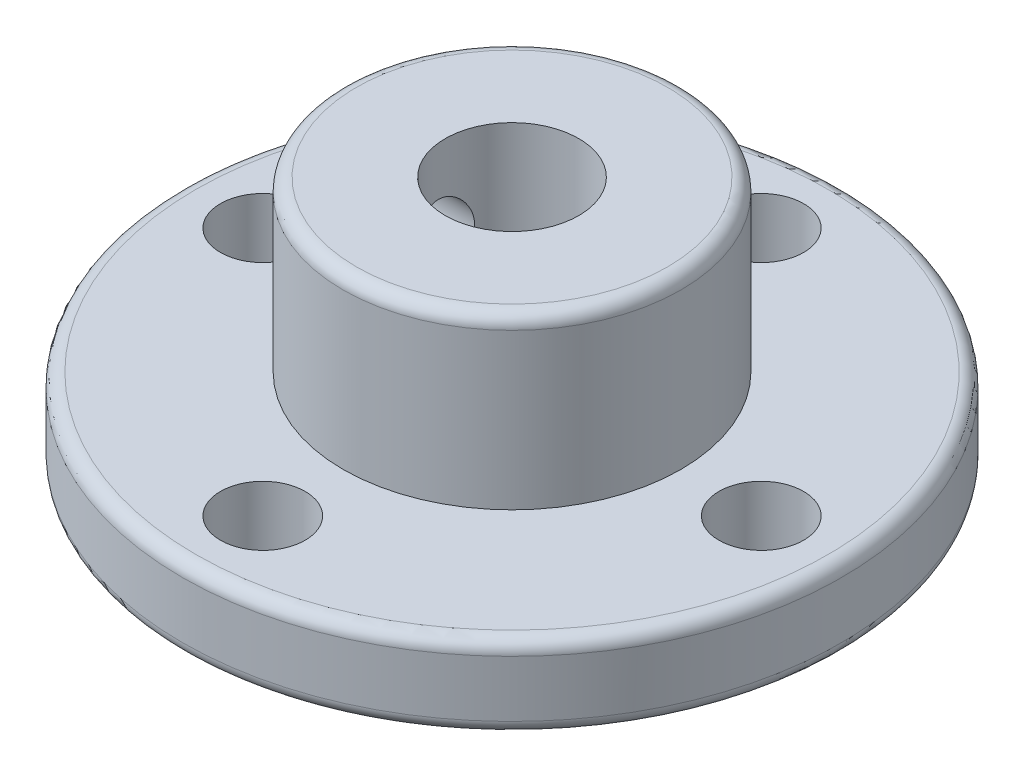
ISO-10303-21;
HEADER;
FILE_DESCRIPTION(('STEP AP214'),'2;1');
FILE_NAME('part.step','',(''),(''),'','','');
FILE_SCHEMA(('AUTOMOTIVE_DESIGN { 1 0 10303 214 1 1 1 1 }'));
ENDSEC;
DATA;
#1=APPLICATION_CONTEXT('core data for automotive mechanical design processes');
#2=APPLICATION_PROTOCOL_DEFINITION('international standard','automotive_design',2000,#1);
#3=PRODUCT_CONTEXT('',#1,'mechanical');
#4=PRODUCT('Part','Part','',(#3));
#5=PRODUCT_RELATED_PRODUCT_CATEGORY('part','',(#4));
#6=PRODUCT_DEFINITION_FORMATION('','',#4);
#7=PRODUCT_DEFINITION_CONTEXT('part definition',#1,'design');
#8=PRODUCT_DEFINITION('design','',#6,#7);
#9=PRODUCT_DEFINITION_SHAPE('','',#8);
#10=(LENGTH_UNIT() NAMED_UNIT(*) SI_UNIT(.MILLI.,.METRE.));
#11=(NAMED_UNIT(*) PLANE_ANGLE_UNIT() SI_UNIT($,.RADIAN.));
#12=(NAMED_UNIT(*) SI_UNIT($,.STERADIAN.) SOLID_ANGLE_UNIT());
#13=UNCERTAINTY_MEASURE_WITH_UNIT(LENGTH_MEASURE(1.E-05),#10,'distance_accuracy_value','');
#14=(GEOMETRIC_REPRESENTATION_CONTEXT(3) GLOBAL_UNCERTAINTY_ASSIGNED_CONTEXT((#13)) GLOBAL_UNIT_ASSIGNED_CONTEXT((#10,
#11,#12)) REPRESENTATION_CONTEXT('',''));
#15=CARTESIAN_POINT('',(0.,0.,0.));
#16=DIRECTION('',(0.,0.,1.));
#17=DIRECTION('',(1.,0.,0.));
#18=AXIS2_PLACEMENT_3D('',#15,#16,#17);
#19=CARTESIAN_POINT('',(0.,8.9361,0.));
#20=DIRECTION('',(0.,1.,0.));
#21=DIRECTION('',(0.,0.,1.));
#22=AXIS2_PLACEMENT_3D('',#19,#20,#21);
#23=TOROIDAL_SURFACE('',#22,5.83095,0.5);
#24=CARTESIAN_POINT('',(0.,9.4361,0.));
#25=DIRECTION('',(0.,-1.,0.));
#26=DIRECTION('',(1.,0.,0.));
#27=AXIS2_PLACEMENT_3D('',#24,#25,#26);
#28=CIRCLE('',#27,5.83095);
#29=CARTESIAN_POINT('',(5.83095,9.4361,0.));
#30=VERTEX_POINT('',#29);
#31=EDGE_CURVE('E131',#30,#30,#28,.F.);
#32=ORIENTED_EDGE('',*,*,#31,.F.);
#33=EDGE_LOOP('',(#32));
#34=FACE_BOUND('',#33,.T.);
#35=CARTESIAN_POINT('',(0.,8.9361,0.));
#36=DIRECTION('',(0.,1.,0.));
#37=DIRECTION('',(0.,0.,1.));
#38=AXIS2_PLACEMENT_3D('',#35,#36,#37);
#39=CIRCLE('',#38,6.33095);
#40=CARTESIAN_POINT('',(0.,8.9361,6.33095));
#41=VERTEX_POINT('',#40);
#42=EDGE_CURVE('E153',#41,#41,#39,.F.);
#43=ORIENTED_EDGE('',*,*,#42,.F.);
#44=EDGE_LOOP('',(#43));
#45=FACE_BOUND('',#44,.T.);
#46=ADVANCED_FACE('F33',(#34,#45),#23,.T.);
#47=CARTESIAN_POINT('',(0.,3.1115,0.));
#48=DIRECTION('',(0.,1.,0.));
#49=DIRECTION('',(0.,0.,1.));
#50=AXIS2_PLACEMENT_3D('',#47,#48,#49);
#51=CYLINDRICAL_SURFACE('',#50,6.33095);
#52=ORIENTED_EDGE('',*,*,#42,.T.);
#53=EDGE_LOOP('',(#52));
#54=FACE_BOUND('',#53,.T.);
#55=CARTESIAN_POINT('',(-6.26356410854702,6.274,-0.9212451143));
#56=CARTESIAN_POINT('',(-6.26356540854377,6.34877461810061,-0.921242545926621));
#57=CARTESIAN_POINT('',(-6.26449924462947,6.42358162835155,-0.91495458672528));
#58=CARTESIAN_POINT('',(-6.2680952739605,6.57109055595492,-0.889979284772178));
#59=CARTESIAN_POINT('',(-6.27075875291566,6.6437908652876,-0.871282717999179));
#60=CARTESIAN_POINT('',(-6.27740077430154,6.78494880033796,-0.822058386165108));
#61=CARTESIAN_POINT('',(-6.2813784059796,6.85340932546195,-0.791538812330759));
#62=CARTESIAN_POINT('',(-6.29003135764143,6.98424318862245,-0.719542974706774));
#63=CARTESIAN_POINT('',(-6.29470662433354,7.04661699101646,-0.67806754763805));
#64=CARTESIAN_POINT('',(-6.3040406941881,7.1639965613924,-0.584975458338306));
#65=CARTESIAN_POINT('',(-6.30869915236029,7.21894763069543,-0.533289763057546));
#66=CARTESIAN_POINT('',(-6.31715940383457,7.3194267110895,-0.421386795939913));
#67=CARTESIAN_POINT('',(-6.32096118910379,7.36495463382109,-0.361169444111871));
#68=CARTESIAN_POINT('',(-6.32694761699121,7.44526247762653,-0.233905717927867));
#69=CARTESIAN_POINT('',(-6.32913292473,7.48004681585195,-0.166862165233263));
#70=CARTESIAN_POINT('',(-6.33126981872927,7.53785884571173,-0.0278529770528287));
#71=CARTESIAN_POINT('',(-6.33122166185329,7.56088788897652,0.0441120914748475));
#72=CARTESIAN_POINT('',(-6.3285182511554,7.59426846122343,0.18976426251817));
#73=CARTESIAN_POINT('',(-6.32590122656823,7.60480088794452,0.263410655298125));
#74=CARTESIAN_POINT('',(-6.31801022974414,7.61353987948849,0.411285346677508));
#75=CARTESIAN_POINT('',(-6.31273637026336,7.61174696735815,0.485513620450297));
#76=CARTESIAN_POINT('',(-6.29974802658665,7.59602168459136,0.632050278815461));
#77=CARTESIAN_POINT('',(-6.2920464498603,7.58215284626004,0.704366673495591));
#78=CARTESIAN_POINT('',(-6.27463672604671,7.54285672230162,0.845531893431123));
#79=CARTESIAN_POINT('',(-6.26492836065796,7.5174281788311,0.914380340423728));
#80=CARTESIAN_POINT('',(-6.24396616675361,7.45520103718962,1.04808520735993));
#81=CARTESIAN_POINT('',(-6.23268672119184,7.41819772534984,1.11284227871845));
#82=CARTESIAN_POINT('',(-6.20958356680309,7.33402100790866,1.23526796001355));
#83=CARTESIAN_POINT('',(-6.19775976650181,7.2868458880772,1.29293537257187));
#84=CARTESIAN_POINT('',(-6.17426440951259,7.18237952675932,1.40089667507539));
#85=CARTESIAN_POINT('',(-6.16260216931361,7.12488566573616,1.45099684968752));
#86=CARTESIAN_POINT('',(-6.14076012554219,7.00203917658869,1.54082330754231));
#87=CARTESIAN_POINT('',(-6.13058027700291,6.93668678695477,1.58054990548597));
#88=CARTESIAN_POINT('',(-6.11275587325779,6.80041006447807,1.64813891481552));
#89=CARTESIAN_POINT('',(-6.10509258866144,6.72953198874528,1.67608943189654));
#90=CARTESIAN_POINT('',(-6.09298203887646,6.58381101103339,1.71959709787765));
#91=CARTESIAN_POINT('',(-6.0885339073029,6.50896918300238,1.73515758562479));
#92=CARTESIAN_POINT('',(-6.08342048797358,6.36023280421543,1.75299922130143));
#93=CARTESIAN_POINT('',(-6.08262938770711,6.2863953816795,1.7557220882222));
#94=CARTESIAN_POINT('',(-6.08456804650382,6.13933001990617,1.74899162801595));
#95=CARTESIAN_POINT('',(-6.08729745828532,6.06610202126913,1.73953950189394));
#96=CARTESIAN_POINT('',(-6.09592372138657,5.92359272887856,1.70905927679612));
#97=CARTESIAN_POINT('',(-6.10176674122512,5.854265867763,1.68822776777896));
#98=CARTESIAN_POINT('',(-6.11603004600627,5.72009736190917,1.63579889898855));
#99=CARTESIAN_POINT('',(-6.12445064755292,5.65525626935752,1.60420021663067));
#100=CARTESIAN_POINT('',(-6.1433368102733,5.53022420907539,1.53030182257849));
#101=CARTESIAN_POINT('',(-6.15384571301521,5.47017802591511,1.48776844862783));
#102=CARTESIAN_POINT('',(-6.17586028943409,5.35794947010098,1.39356136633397));
#103=CARTESIAN_POINT('',(-6.18736615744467,5.3057686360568,1.34188587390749));
#104=CARTESIAN_POINT('',(-6.21081306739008,5.2089885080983,1.2288857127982));
#105=CARTESIAN_POINT('',(-6.22275602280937,5.16469339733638,1.1673005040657));
#106=CARTESIAN_POINT('',(-6.24572334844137,5.08707071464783,1.03740668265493));
#107=CARTESIAN_POINT('',(-6.25674769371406,5.05374344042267,0.969097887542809));
#108=CARTESIAN_POINT('',(-6.27705968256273,4.99898846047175,0.827394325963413));
#109=CARTESIAN_POINT('',(-6.28634249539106,4.97759353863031,0.753986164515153));
#110=CARTESIAN_POINT('',(-6.30248783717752,4.94759551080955,0.604344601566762));
#111=CARTESIAN_POINT('',(-6.30935076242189,4.93899030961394,0.528111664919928));
#112=CARTESIAN_POINT('',(-6.32016223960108,4.93499282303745,0.376938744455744));
#113=CARTESIAN_POINT('',(-6.3241768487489,4.93928806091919,0.302011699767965));
#114=CARTESIAN_POINT('',(-6.32951476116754,4.96036278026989,0.153839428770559));
#115=CARTESIAN_POINT('',(-6.33083830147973,4.97714116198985,0.0805940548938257));
#116=CARTESIAN_POINT('',(-6.33104651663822,5.02235763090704,-0.060960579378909));
#117=CARTESIAN_POINT('',(-6.32996828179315,5.05061296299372,-0.129328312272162));
#118=CARTESIAN_POINT('',(-6.32593134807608,5.11796038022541,-0.260435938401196));
#119=CARTESIAN_POINT('',(-6.32297258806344,5.15705281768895,-0.323175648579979));
#120=CARTESIAN_POINT('',(-6.31579558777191,5.2453624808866,-0.441841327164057));
#121=CARTESIAN_POINT('',(-6.31156660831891,5.29466487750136,-0.497703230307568));
#122=CARTESIAN_POINT('',(-6.30262036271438,5.40183218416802,-0.600476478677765));
#123=CARTESIAN_POINT('',(-6.29790298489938,5.45969905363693,-0.647385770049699));
#124=CARTESIAN_POINT('',(-6.28868685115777,5.58326692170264,-0.731551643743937));
#125=CARTESIAN_POINT('',(-6.2841919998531,5.64906481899,-0.768666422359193));
#126=CARTESIAN_POINT('',(-6.27621432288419,5.78598136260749,-0.831303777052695));
#127=CARTESIAN_POINT('',(-6.27273071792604,5.85709585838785,-0.856835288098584));
#128=CARTESIAN_POINT('',(-6.26793645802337,5.98589267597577,-0.891135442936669));
#129=CARTESIAN_POINT('',(-6.26631054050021,6.04291029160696,-0.902406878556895));
#130=CARTESIAN_POINT('',(-6.26412387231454,6.15794544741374,-0.917462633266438));
#131=CARTESIAN_POINT('',(-6.26356309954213,6.21596296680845,-0.9212471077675));
#132=CARTESIAN_POINT('',(-6.26356410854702,6.274,-0.9212451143));
#133=B_SPLINE_CURVE_WITH_KNOTS('',3,(#55,#56,#57,#58,#59,#60,#61,#62,#63,#64,#65,#66,#67,#68,
#69,#70,#71,#72,#73,#74,#75,#76,#77,#78,#79,#80,#81,#82,#83,#84,#85,#86,#87,#88,#89,#90,#91,#92,
#93,#94,#95,#96,#97,#98,#99,#100,#101,#102,#103,#104,#105,#106,#107,#108,#109,#110,#111,#112,
#113,#114,#115,#116,#117,#118,#119,#120,#121,#122,#123,#124,#125,#126,#127,#128,#129,#130,#131,
#132),.UNSPECIFIED.,.T.,.F.,(4,2,2,2,2,2,2,2,2,2,2,2,2,2,2,2,2,2,2,2,2,2,2,2,2,2,2,2,2,2,2,2,2,
2,2,2,2,2,4),(0.,0.224113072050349,0.448392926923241,0.672517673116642,0.896625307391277,
1.12230349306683,1.34798379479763,1.57357118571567,1.79913263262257,2.02138744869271,
2.2436328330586,2.46471598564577,2.68582320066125,2.91108604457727,3.13638688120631,
3.36672570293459,3.59705753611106,3.82563409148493,4.05414902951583,4.27474082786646,
4.49531086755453,4.71218560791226,4.9290869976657,5.15107706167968,5.37311049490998,
5.60241391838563,5.83172356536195,6.06166017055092,6.29155910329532,6.51593465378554,
6.74029043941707,6.96120558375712,7.18212791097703,7.40497329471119,7.62786974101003,
7.85383529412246,8.0796262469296,8.25357735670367,8.42752485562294),.UNSPECIFIED.);
#134=CARTESIAN_POINT('',(-6.26356410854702,6.274,-0.9212451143));
#135=VERTEX_POINT('',#134);
#136=EDGE_CURVE('E38',#135,#135,#133,.T.);
#137=ORIENTED_EDGE('',*,*,#136,.T.);
#138=EDGE_LOOP('',(#137));
#139=FACE_BOUND('',#138,.T.);
#140=CARTESIAN_POINT('',(0.,3.1115,0.));
#141=DIRECTION('',(0.,1.,0.));
#142=DIRECTION('',(0.,0.,1.));
#143=AXIS2_PLACEMENT_3D('',#140,#141,#142);
#144=CIRCLE('',#143,6.33095);
#145=CARTESIAN_POINT('',(0.,3.1115,6.33095));
#146=VERTEX_POINT('',#145);
#147=EDGE_CURVE('E92',#146,#146,#144,.F.);
#148=ORIENTED_EDGE('',*,*,#147,.F.);
#149=EDGE_LOOP('',(#148));
#150=FACE_BOUND('',#149,.T.);
#151=ADVANCED_FACE('F147',(#54,#139,#150),#51,.T.);
#152=CARTESIAN_POINT('',(0.,2.6115,0.));
#153=DIRECTION('',(0.,1.,0.));
#154=DIRECTION('',(0.,0.,1.));
#155=AXIS2_PLACEMENT_3D('',#152,#153,#154);
#156=TOROIDAL_SURFACE('',#155,11.85075,0.5);
#157=CARTESIAN_POINT('',(0.,3.1115,0.));
#158=DIRECTION('',(0.,-1.,0.));
#159=DIRECTION('',(-1.,0.,0.));
#160=AXIS2_PLACEMENT_3D('',#157,#158,#159);
#161=CIRCLE('',#160,11.85075);
#162=CARTESIAN_POINT('',(-11.85075,3.1115,0.));
#163=VERTEX_POINT('',#162);
#164=EDGE_CURVE('E166',#163,#163,#161,.F.);
#165=ORIENTED_EDGE('',*,*,#164,.F.);
#166=EDGE_LOOP('',(#165));
#167=FACE_BOUND('',#166,.T.);
#168=CARTESIAN_POINT('',(0.,2.6115,0.));
#169=DIRECTION('',(0.,1.,0.));
#170=DIRECTION('',(0.,0.,1.));
#171=AXIS2_PLACEMENT_3D('',#168,#169,#170);
#172=CIRCLE('',#171,12.35075);
#173=CARTESIAN_POINT('',(0.,2.6115,12.35075));
#174=VERTEX_POINT('',#173);
#175=EDGE_CURVE('E91',#174,#174,#172,.F.);
#176=ORIENTED_EDGE('',*,*,#175,.F.);
#177=EDGE_LOOP('',(#176));
#178=FACE_BOUND('',#177,.T.);
#179=ADVANCED_FACE('F144',(#167,#178),#156,.T.);
#180=CARTESIAN_POINT('',(-36.1851929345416,6.274,0.4162548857));
#181=DIRECTION('',(1.,0.,0.));
#182=DIRECTION('',(0.,0.,-1.));
#183=AXIS2_PLACEMENT_3D('',#180,#181,#182);
#184=CYLINDRICAL_SURFACE('',#183,1.3375);
#185=ORIENTED_EDGE('',*,*,#136,.F.);
#186=EDGE_LOOP('',(#185));
#187=FACE_BOUND('',#186,.T.);
#188=CARTESIAN_POINT('',(-2.32611501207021,6.274,-0.9212451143));
#189=CARTESIAN_POINT('',(-2.32611521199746,6.3467020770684,-0.921244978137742));
#190=CARTESIAN_POINT('',(-2.32849799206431,6.41940549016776,-0.915295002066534));
#191=CARTESIAN_POINT('',(-2.33761473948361,6.56262588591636,-0.891748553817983));
#192=CARTESIAN_POINT('',(-2.34435032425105,6.63314204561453,-0.874147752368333));
#193=CARTESIAN_POINT('',(-2.3610328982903,6.76985663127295,-0.828022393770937));
#194=CARTESIAN_POINT('',(-2.37097105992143,6.83606633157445,-0.799527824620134));
#195=CARTESIAN_POINT('',(-2.39254224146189,6.96286305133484,-0.732449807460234));
#196=CARTESIAN_POINT('',(-2.40417580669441,7.02344825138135,-0.693863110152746));
#197=CARTESIAN_POINT('',(-2.42797074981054,7.14031746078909,-0.60551288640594));
#198=CARTESIAN_POINT('',(-2.44013177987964,7.1962752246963,-0.555316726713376));
#199=CARTESIAN_POINT('',(-2.46245375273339,7.29919556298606,-0.446017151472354));
#200=CARTESIAN_POINT('',(-2.47261469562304,7.3461581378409,-0.386913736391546));
#201=CARTESIAN_POINT('',(-2.48903984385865,7.4297331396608,-0.261159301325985));
#202=CARTESIAN_POINT('',(-2.49529927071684,7.46633284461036,-0.194499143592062));
#203=CARTESIAN_POINT('',(-2.50224160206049,7.52775915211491,-0.0557001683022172));
#204=CARTESIAN_POINT('',(-2.5029287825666,7.55259476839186,0.0164344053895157));
#205=CARTESIAN_POINT('',(-2.4978496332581,7.58808550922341,0.157537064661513));
#206=CARTESIAN_POINT('',(-2.49261276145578,7.5997442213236,0.226273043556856));
#207=CARTESIAN_POINT('',(-2.47624782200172,7.61226651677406,0.364014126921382));
#208=CARTESIAN_POINT('',(-2.4651206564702,7.61313175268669,0.433019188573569));
#209=CARTESIAN_POINT('',(-2.43779999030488,7.60463979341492,0.566675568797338));
#210=CARTESIAN_POINT('',(-2.42180851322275,7.59565849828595,0.631393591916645));
#211=CARTESIAN_POINT('',(-2.38533756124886,7.56881385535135,0.757620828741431));
#212=CARTESIAN_POINT('',(-2.36485710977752,7.55094857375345,0.819129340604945));
#213=CARTESIAN_POINT('',(-2.31853750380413,7.50546033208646,0.942646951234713));
#214=CARTESIAN_POINT('',(-2.29239891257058,7.47716504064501,1.00429417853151));
#215=CARTESIAN_POINT('',(-2.2372965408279,7.41231088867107,1.12170524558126));
#216=CARTESIAN_POINT('',(-2.20833064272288,7.37574580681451,1.17746460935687));
#217=CARTESIAN_POINT('',(-2.1444880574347,7.28906101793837,1.29054414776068));
#218=CARTESIAN_POINT('',(-2.10938389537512,7.23772436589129,1.34680410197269));
#219=CARTESIAN_POINT('',(-2.03978343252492,7.12602722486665,1.45005573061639));
#220=CARTESIAN_POINT('',(-2.00528736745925,7.06566331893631,1.49704387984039));
#221=CARTESIAN_POINT('',(-1.94499738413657,6.94632362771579,1.57432878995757));
#222=CARTESIAN_POINT('',(-1.91868051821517,6.88855732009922,1.60608056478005));
#223=CARTESIAN_POINT('',(-1.87111358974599,6.76725735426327,1.66125398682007));
#224=CARTESIAN_POINT('',(-1.84985401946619,6.70373483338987,1.68469130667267));
#225=CARTESIAN_POINT('',(-1.81869708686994,6.58512800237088,1.71821493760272));
#226=CARTESIAN_POINT('',(-1.80737433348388,6.53091699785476,1.73003860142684));
#227=CARTESIAN_POINT('',(-1.79111191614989,6.42052615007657,1.74687254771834));
#228=CARTESIAN_POINT('',(-1.78616468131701,6.36434872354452,1.75189091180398));
#229=CARTESIAN_POINT('',(-1.78334816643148,6.25147739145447,1.75475883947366));
#230=CARTESIAN_POINT('',(-1.78549735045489,6.19478252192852,1.75258970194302));
#231=CARTESIAN_POINT('',(-1.79659030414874,6.08277148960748,1.74121373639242));
#232=CARTESIAN_POINT('',(-1.80554051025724,6.02745668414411,1.73200024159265));
#233=CARTESIAN_POINT('',(-1.83148529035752,5.90851133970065,1.70457773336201));
#234=CARTESIAN_POINT('',(-1.84975299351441,5.84550122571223,1.68491163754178));
#235=CARTESIAN_POINT('',(-1.89189373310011,5.72461470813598,1.63745110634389));
#236=CARTESIAN_POINT('',(-1.91577815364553,5.66674906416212,1.60964013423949));
#237=CARTESIAN_POINT('',(-1.97414401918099,5.54078241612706,1.53784311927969));
#238=CARTESIAN_POINT('',(-2.00969790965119,5.47452172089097,1.49150549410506));
#239=CARTESIAN_POINT('',(-2.08234483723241,5.35177521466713,1.38828627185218));
#240=CARTESIAN_POINT('',(-2.11943913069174,5.29529758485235,1.33139593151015));
#241=CARTESIAN_POINT('',(-2.19250216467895,5.19250346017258,1.20733941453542));
#242=CARTESIAN_POINT('',(-2.22845764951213,5.14628374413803,1.14008473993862));
#243=CARTESIAN_POINT('',(-2.29615483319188,5.06623708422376,0.996711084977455));
#244=CARTESIAN_POINT('',(-2.32790332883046,5.03238999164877,0.920606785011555));
#245=CARTESIAN_POINT('',(-2.37911873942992,4.98434077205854,0.777108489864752));
#246=CARTESIAN_POINT('',(-2.3997723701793,4.96756887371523,0.710997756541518));
#247=CARTESIAN_POINT('',(-2.43579251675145,4.94425366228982,0.575597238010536));
#248=CARTESIAN_POINT('',(-2.45116234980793,4.93770392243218,0.506309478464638));
#249=CARTESIAN_POINT('',(-2.47597449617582,4.93559569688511,0.366236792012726));
#250=CARTESIAN_POINT('',(-2.4853955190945,4.94007641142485,0.295447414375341));
#251=CARTESIAN_POINT('',(-2.49809355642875,4.96035689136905,0.154942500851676));
#252=CARTESIAN_POINT('',(-2.50137076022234,4.97615630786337,0.0852269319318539));
#253=CARTESIAN_POINT('',(-2.50228252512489,5.01739228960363,-0.0467075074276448));
#254=CARTESIAN_POINT('',(-2.50024407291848,5.04219325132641,-0.109125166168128));
#255=CARTESIAN_POINT('',(-2.49209654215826,5.10071340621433,-0.22932663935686));
#256=CARTESIAN_POINT('',(-2.48598692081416,5.13443378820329,-0.287109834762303));
#257=CARTESIAN_POINT('',(-2.47053411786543,5.21151145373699,-0.399126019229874));
#258=CARTESIAN_POINT('',(-2.46106231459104,5.2552229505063,-0.453096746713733));
#259=CARTESIAN_POINT('',(-2.44044645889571,5.35027042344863,-0.553494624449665));
#260=CARTESIAN_POINT('',(-2.42930151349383,5.40161047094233,-0.599917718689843));
#261=CARTESIAN_POINT('',(-2.40596320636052,5.51536226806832,-0.687810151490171));
#262=CARTESIAN_POINT('',(-2.39375965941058,5.5783394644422,-0.728547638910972));
#263=CARTESIAN_POINT('',(-2.37116348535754,5.71046694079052,-0.79903930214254));
#264=CARTESIAN_POINT('',(-2.36077047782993,5.77961591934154,-0.82879578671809));
#265=CARTESIAN_POINT('',(-2.34395762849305,5.91876226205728,-0.87518457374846));
#266=CARTESIAN_POINT('',(-2.33736482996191,5.98854359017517,-0.892399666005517));
#267=CARTESIAN_POINT('',(-2.32844441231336,6.13021684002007,-0.915427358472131));
#268=CARTESIAN_POINT('',(-2.32611481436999,6.202107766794,-0.921245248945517));
#269=CARTESIAN_POINT('',(-2.32611501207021,6.274,-0.9212451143));
#270=B_SPLINE_CURVE_WITH_KNOTS('',3,(#188,#189,#190,#191,#192,#193,#194,#195,#196,#197,#198,
#199,#200,#201,#202,#203,#204,#205,#206,#207,#208,#209,#210,#211,#212,#213,#214,#215,#216,#217,
#218,#219,#220,#221,#222,#223,#224,#225,#226,#227,#228,#229,#230,#231,#232,#233,#234,#235,#236,
#237,#238,#239,#240,#241,#242,#243,#244,#245,#246,#247,#248,#249,#250,#251,#252,#253,#254,#255,
#256,#257,#258,#259,#260,#261,#262,#263,#264,#265,#266,#267,#268,#269),.UNSPECIFIED.,.T.,.F.,(4,
2,2,2,2,2,2,2,2,2,2,2,2,2,2,2,2,2,2,2,2,2,2,2,2,2,2,2,2,2,2,2,2,2,2,2,2,2,2,2,4),(0.,
0.217835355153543,0.435751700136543,0.653072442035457,0.870463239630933,1.09785824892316,
1.32525324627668,1.55292620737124,1.780424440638,1.98909233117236,2.19772827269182,
2.39866820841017,2.59965190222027,2.81689108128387,3.03429423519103,3.28487234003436,
3.5355455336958,3.74773681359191,3.95952596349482,4.12870820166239,4.29768935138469,
4.46711051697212,4.63669222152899,4.84104461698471,5.04581482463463,5.30945662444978,
5.57331784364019,5.83957160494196,6.10538982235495,6.31827566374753,6.53102760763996,
6.74453672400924,6.95803925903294,7.15872244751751,7.35943239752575,7.56883779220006,
7.77835534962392,8.00527743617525,8.23215178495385,8.4476606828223,8.66306952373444),.UNSPECIFIED.);
#271=CARTESIAN_POINT('',(-2.32611501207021,6.274,-0.9212451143));
#272=VERTEX_POINT('',#271);
#273=EDGE_CURVE('E86',#272,#272,#270,.T.);
#274=ORIENTED_EDGE('',*,*,#273,.T.);
#275=EDGE_LOOP('',(#274));
#276=FACE_BOUND('',#275,.T.);
#277=ADVANCED_FACE('F93',(#187,#276),#184,.F.);
#278=CARTESIAN_POINT('',(0.,9.4361,0.));
#279=DIRECTION('',(0.,1.,0.));
#280=DIRECTION('',(0.,0.,1.));
#281=AXIS2_PLACEMENT_3D('',#278,#279,#280);
#282=PLANE('',#281);
#283=ORIENTED_EDGE('',*,*,#31,.T.);
#284=EDGE_LOOP('',(#283));
#285=FACE_BOUND('',#284,.T.);
#286=CARTESIAN_POINT('',(0.,9.4361,0.));
#287=DIRECTION('',(0.,1.,0.));
#288=DIRECTION('',(0.,0.,1.));
#289=AXIS2_PLACEMENT_3D('',#286,#287,#288);
#290=CIRCLE('',#289,2.5019);
#291=CARTESIAN_POINT('',(0.,9.4361,2.5019));
#292=VERTEX_POINT('',#291);
#293=EDGE_CURVE('E83',#292,#292,#290,.F.);
#294=ORIENTED_EDGE('',*,*,#293,.T.);
#295=EDGE_LOOP('',(#294));
#296=FACE_BOUND('',#295,.T.);
#297=ADVANCED_FACE('F112',(#285,#296),#282,.T.);
#298=CARTESIAN_POINT('',(0.,3.1115,0.));
#299=DIRECTION('',(0.,1.,0.));
#300=DIRECTION('',(0.,0.,1.));
#301=AXIS2_PLACEMENT_3D('',#298,#299,#300);
#302=PLANE('',#301);
#303=ORIENTED_EDGE('',*,*,#164,.T.);
#304=EDGE_LOOP('',(#303));
#305=FACE_BOUND('',#304,.T.);
#306=CARTESIAN_POINT('',(0.,3.1115,9.341));
#307=DIRECTION('',(0.,1.,0.));
#308=DIRECTION('',(0.,0.,1.));
#309=AXIS2_PLACEMENT_3D('',#306,#307,#308);
#310=CIRCLE('',#309,1.5875);
#311=CARTESIAN_POINT('',(0.,3.1115,10.9285));
#312=VERTEX_POINT('',#311);
#313=EDGE_CURVE('E71',#312,#312,#310,.F.);
#314=ORIENTED_EDGE('',*,*,#313,.T.);
#315=EDGE_LOOP('',(#314));
#316=FACE_BOUND('',#315,.T.);
#317=CARTESIAN_POINT('',(-9.341,3.1115,0.));
#318=DIRECTION('',(0.,1.,0.));
#319=DIRECTION('',(0.,0.,1.));
#320=AXIS2_PLACEMENT_3D('',#317,#318,#319);
#321=CIRCLE('',#320,1.5875);
#322=CARTESIAN_POINT('',(-9.341,3.1115,1.5875));
#323=VERTEX_POINT('',#322);
#324=EDGE_CURVE('E74',#323,#323,#321,.F.);
#325=ORIENTED_EDGE('',*,*,#324,.T.);
#326=EDGE_LOOP('',(#325));
#327=FACE_BOUND('',#326,.T.);
#328=CARTESIAN_POINT('',(0.,3.1115,-9.341));
#329=DIRECTION('',(0.,1.,0.));
#330=DIRECTION('',(0.,0.,1.));
#331=AXIS2_PLACEMENT_3D('',#328,#329,#330);
#332=CIRCLE('',#331,1.5875);
#333=CARTESIAN_POINT('',(0.,3.1115,-7.7535));
#334=VERTEX_POINT('',#333);
#335=EDGE_CURVE('E77',#334,#334,#332,.F.);
#336=ORIENTED_EDGE('',*,*,#335,.T.);
#337=EDGE_LOOP('',(#336));
#338=FACE_BOUND('',#337,.T.);
#339=CARTESIAN_POINT('',(9.341,3.1115,0.));
#340=DIRECTION('',(0.,1.,0.));
#341=DIRECTION('',(0.,0.,1.));
#342=AXIS2_PLACEMENT_3D('',#339,#340,#341);
#343=CIRCLE('',#342,1.5875);
#344=CARTESIAN_POINT('',(9.341,3.1115,1.5875));
#345=VERTEX_POINT('',#344);
#346=EDGE_CURVE('E80',#345,#345,#343,.F.);
#347=ORIENTED_EDGE('',*,*,#346,.T.);
#348=EDGE_LOOP('',(#347));
#349=FACE_BOUND('',#348,.T.);
#350=ORIENTED_EDGE('',*,*,#147,.T.);
#351=EDGE_LOOP('',(#350));
#352=FACE_BOUND('',#351,.T.);
#353=ADVANCED_FACE('F108',(#305,#316,#327,#338,#349,#352),#302,.T.);
#354=CARTESIAN_POINT('',(0.,0.,0.));
#355=DIRECTION('',(0.,1.,0.));
#356=DIRECTION('',(0.,0.,1.));
#357=AXIS2_PLACEMENT_3D('',#354,#355,#356);
#358=CYLINDRICAL_SURFACE('',#357,12.35075);
#359=CARTESIAN_POINT('',(0.,0.5,0.));
#360=DIRECTION('',(0.,-1.,0.));
#361=DIRECTION('',(0.,0.,-1.));
#362=AXIS2_PLACEMENT_3D('',#359,#360,#361);
#363=CIRCLE('',#362,12.35075);
#364=CARTESIAN_POINT('',(0.,0.5,-12.35075));
#365=VERTEX_POINT('',#364);
#366=EDGE_CURVE('E70',#365,#365,#363,.T.);
#367=ORIENTED_EDGE('',*,*,#366,.F.);
#368=EDGE_LOOP('',(#367));
#369=FACE_BOUND('',#368,.T.);
#370=ORIENTED_EDGE('',*,*,#175,.T.);
#371=EDGE_LOOP('',(#370));
#372=FACE_BOUND('',#371,.T.);
#373=ADVANCED_FACE('F103',(#369,#372),#358,.T.);
#374=CARTESIAN_POINT('',(0.,-26.7490929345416,0.));
#375=DIRECTION('',(0.,1.,0.));
#376=DIRECTION('',(0.,0.,1.));
#377=AXIS2_PLACEMENT_3D('',#374,#375,#376);
#378=CYLINDRICAL_SURFACE('',#377,2.5019);
#379=ORIENTED_EDGE('',*,*,#293,.F.);
#380=EDGE_LOOP('',(#379));
#381=FACE_BOUND('',#380,.T.);
#382=CARTESIAN_POINT('',(0.,0.,0.));
#383=DIRECTION('',(0.,1.,0.));
#384=DIRECTION('',(0.,0.,1.));
#385=AXIS2_PLACEMENT_3D('',#382,#383,#384);
#386=CIRCLE('',#385,2.5019);
#387=CARTESIAN_POINT('',(0.,0.,2.5019));
#388=VERTEX_POINT('',#387);
#389=EDGE_CURVE('E67',#388,#388,#386,.F.);
#390=ORIENTED_EDGE('',*,*,#389,.T.);
#391=EDGE_LOOP('',(#390));
#392=FACE_BOUND('',#391,.T.);
#393=ORIENTED_EDGE('',*,*,#273,.F.);
#394=EDGE_LOOP('',(#393));
#395=FACE_BOUND('',#394,.T.);
#396=ADVANCED_FACE('F97',(#381,#392,#395),#378,.F.);
#397=CARTESIAN_POINT('',(9.341,-33.0736929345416,0.));
#398=DIRECTION('',(0.,1.,0.));
#399=DIRECTION('',(0.,0.,1.));
#400=AXIS2_PLACEMENT_3D('',#397,#398,#399);
#401=CYLINDRICAL_SURFACE('',#400,1.5875);
#402=ORIENTED_EDGE('',*,*,#346,.F.);
#403=EDGE_LOOP('',(#402));
#404=FACE_BOUND('',#403,.T.);
#405=CARTESIAN_POINT('',(9.341,0.,0.));
#406=DIRECTION('',(0.,1.,0.));
#407=DIRECTION('',(0.,0.,1.));
#408=AXIS2_PLACEMENT_3D('',#405,#406,#407);
#409=CIRCLE('',#408,1.5875);
#410=CARTESIAN_POINT('',(9.341,0.,1.5875));
#411=VERTEX_POINT('',#410);
#412=EDGE_CURVE('E64',#411,#411,#409,.F.);
#413=ORIENTED_EDGE('',*,*,#412,.T.);
#414=EDGE_LOOP('',(#413));
#415=FACE_BOUND('',#414,.T.);
#416=ADVANCED_FACE('F102',(#404,#415),#401,.F.);
#417=CARTESIAN_POINT('',(0.,-33.0736929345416,-9.341));
#418=DIRECTION('',(0.,1.,0.));
#419=DIRECTION('',(0.,0.,1.));
#420=AXIS2_PLACEMENT_3D('',#417,#418,#419);
#421=CYLINDRICAL_SURFACE('',#420,1.5875);
#422=ORIENTED_EDGE('',*,*,#335,.F.);
#423=EDGE_LOOP('',(#422));
#424=FACE_BOUND('',#423,.T.);
#425=CARTESIAN_POINT('',(0.,0.,-9.341));
#426=DIRECTION('',(0.,1.,0.));
#427=DIRECTION('',(0.,0.,1.));
#428=AXIS2_PLACEMENT_3D('',#425,#426,#427);
#429=CIRCLE('',#428,1.5875);
#430=CARTESIAN_POINT('',(0.,0.,-7.7535));
#431=VERTEX_POINT('',#430);
#432=EDGE_CURVE('E55',#431,#431,#429,.F.);
#433=ORIENTED_EDGE('',*,*,#432,.T.);
#434=EDGE_LOOP('',(#433));
#435=FACE_BOUND('',#434,.T.);
#436=ADVANCED_FACE('F228',(#424,#435),#421,.F.);
#437=CARTESIAN_POINT('',(-9.341,-33.0736929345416,0.));
#438=DIRECTION('',(0.,1.,0.));
#439=DIRECTION('',(0.,0.,1.));
#440=AXIS2_PLACEMENT_3D('',#437,#438,#439);
#441=CYLINDRICAL_SURFACE('',#440,1.5875);
#442=ORIENTED_EDGE('',*,*,#324,.F.);
#443=EDGE_LOOP('',(#442));
#444=FACE_BOUND('',#443,.T.);
#445=CARTESIAN_POINT('',(-9.341,0.,0.));
#446=DIRECTION('',(0.,1.,0.));
#447=DIRECTION('',(0.,0.,1.));
#448=AXIS2_PLACEMENT_3D('',#445,#446,#447);
#449=CIRCLE('',#448,1.5875);
#450=CARTESIAN_POINT('',(-9.341,0.,1.5875));
#451=VERTEX_POINT('',#450);
#452=EDGE_CURVE('E50',#451,#451,#449,.F.);
#453=ORIENTED_EDGE('',*,*,#452,.T.);
#454=EDGE_LOOP('',(#453));
#455=FACE_BOUND('',#454,.T.);
#456=ADVANCED_FACE('F237',(#444,#455),#441,.F.);
#457=CARTESIAN_POINT('',(0.,-33.0736929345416,9.341));
#458=DIRECTION('',(0.,1.,0.));
#459=DIRECTION('',(0.,0.,1.));
#460=AXIS2_PLACEMENT_3D('',#457,#458,#459);
#461=CYLINDRICAL_SURFACE('',#460,1.5875);
#462=ORIENTED_EDGE('',*,*,#313,.F.);
#463=EDGE_LOOP('',(#462));
#464=FACE_BOUND('',#463,.T.);
#465=CARTESIAN_POINT('',(0.,0.,9.341));
#466=DIRECTION('',(0.,1.,0.));
#467=DIRECTION('',(0.,0.,1.));
#468=AXIS2_PLACEMENT_3D('',#465,#466,#467);
#469=CIRCLE('',#468,1.5875);
#470=CARTESIAN_POINT('',(0.,0.,10.9285));
#471=VERTEX_POINT('',#470);
#472=EDGE_CURVE('E45',#471,#471,#469,.F.);
#473=ORIENTED_EDGE('',*,*,#472,.T.);
#474=EDGE_LOOP('',(#473));
#475=FACE_BOUND('',#474,.T.);
#476=ADVANCED_FACE('F246',(#464,#475),#461,.F.);
#477=CARTESIAN_POINT('',(0.,0.5,0.));
#478=DIRECTION('',(0.,-1.,0.));
#479=DIRECTION('',(0.,0.,-1.));
#480=AXIS2_PLACEMENT_3D('',#477,#478,#479);
#481=TOROIDAL_SURFACE('',#480,11.85075,0.5);
#482=CARTESIAN_POINT('',(0.,0.,0.));
#483=DIRECTION('',(0.,1.,0.));
#484=DIRECTION('',(-1.,0.,0.));
#485=AXIS2_PLACEMENT_3D('',#482,#483,#484);
#486=CIRCLE('',#485,11.85075);
#487=CARTESIAN_POINT('',(-11.85075,0.,0.));
#488=VERTEX_POINT('',#487);
#489=EDGE_CURVE('E10',#488,#488,#486,.T.);
#490=ORIENTED_EDGE('',*,*,#489,.T.);
#491=EDGE_LOOP('',(#490));
#492=FACE_BOUND('',#491,.T.);
#493=ORIENTED_EDGE('',*,*,#366,.T.);
#494=EDGE_LOOP('',(#493));
#495=FACE_BOUND('',#494,.T.);
#496=ADVANCED_FACE('F256',(#492,#495),#481,.T.);
#497=CARTESIAN_POINT('',(0.,0.,0.));
#498=DIRECTION('',(0.,1.,0.));
#499=DIRECTION('',(0.,0.,1.));
#500=AXIS2_PLACEMENT_3D('',#497,#498,#499);
#501=PLANE('',#500);
#502=ORIENTED_EDGE('',*,*,#489,.F.);
#503=EDGE_LOOP('',(#502));
#504=FACE_BOUND('',#503,.T.);
#505=ORIENTED_EDGE('',*,*,#472,.F.);
#506=EDGE_LOOP('',(#505));
#507=FACE_BOUND('',#506,.T.);
#508=ORIENTED_EDGE('',*,*,#452,.F.);
#509=EDGE_LOOP('',(#508));
#510=FACE_BOUND('',#509,.T.);
#511=ORIENTED_EDGE('',*,*,#432,.F.);
#512=EDGE_LOOP('',(#511));
#513=FACE_BOUND('',#512,.T.);
#514=ORIENTED_EDGE('',*,*,#412,.F.);
#515=EDGE_LOOP('',(#514));
#516=FACE_BOUND('',#515,.T.);
#517=ORIENTED_EDGE('',*,*,#389,.F.);
#518=EDGE_LOOP('',(#517));
#519=FACE_BOUND('',#518,.T.);
#520=ADVANCED_FACE('F266',(#504,#507,#510,#513,#516,#519),#501,.F.);
#521=CLOSED_SHELL('',(#46,#151,#179,#277,#297,#353,#373,#396,#416,#436,#456,#476,#496,#520));
#522=MANIFOLD_SOLID_BREP('B2',#521);
#523=ADVANCED_BREP_SHAPE_REPRESENTATION('',(#18,#522),#14);
#524=SHAPE_DEFINITION_REPRESENTATION(#9,#523);
ENDSEC;
END-ISO-10303-21;
